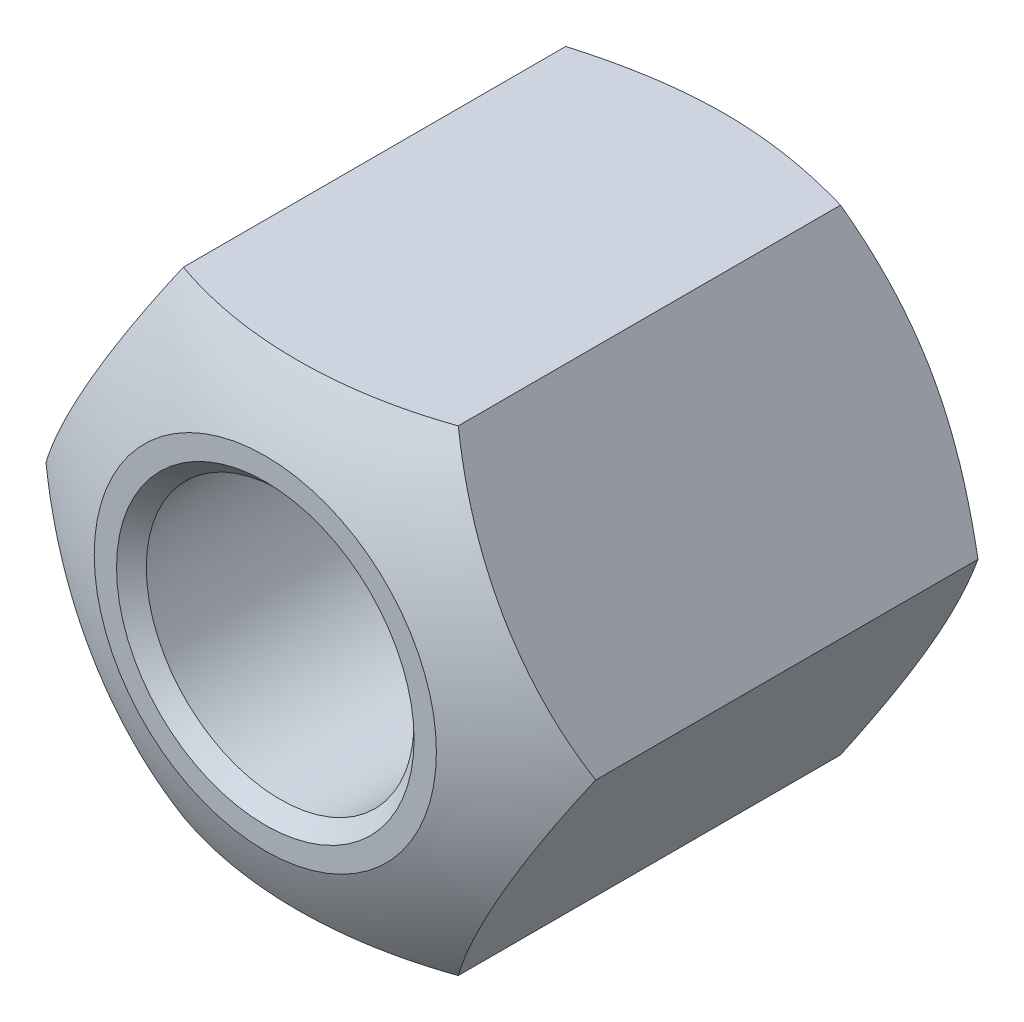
ISO-10303-21;
HEADER;
FILE_DESCRIPTION(('STEP AP214'),'2;1');
FILE_NAME('part.step','',(''),(''),'','','');
FILE_SCHEMA(('AUTOMOTIVE_DESIGN { 1 0 10303 214 1 1 1 1 }'));
ENDSEC;
DATA;
#1=APPLICATION_CONTEXT('core data for automotive mechanical design processes');
#2=APPLICATION_PROTOCOL_DEFINITION('international standard','automotive_design',2000,#1);
#3=PRODUCT_CONTEXT('',#1,'mechanical');
#4=PRODUCT('Part','Part','',(#3));
#5=PRODUCT_RELATED_PRODUCT_CATEGORY('part','',(#4));
#6=PRODUCT_DEFINITION_FORMATION('','',#4);
#7=PRODUCT_DEFINITION_CONTEXT('part definition',#1,'design');
#8=PRODUCT_DEFINITION('design','',#6,#7);
#9=PRODUCT_DEFINITION_SHAPE('','',#8);
#10=(LENGTH_UNIT() NAMED_UNIT(*) SI_UNIT(.MILLI.,.METRE.));
#11=(NAMED_UNIT(*) PLANE_ANGLE_UNIT() SI_UNIT($,.RADIAN.));
#12=(NAMED_UNIT(*) SI_UNIT($,.STERADIAN.) SOLID_ANGLE_UNIT());
#13=UNCERTAINTY_MEASURE_WITH_UNIT(LENGTH_MEASURE(1.E-05),#10,'distance_accuracy_value','');
#14=(GEOMETRIC_REPRESENTATION_CONTEXT(3) GLOBAL_UNCERTAINTY_ASSIGNED_CONTEXT((#13)) GLOBAL_UNIT_ASSIGNED_CONTEXT((#10,
#11,#12)) REPRESENTATION_CONTEXT('',''));
#15=CARTESIAN_POINT('',(0.,0.,0.));
#16=DIRECTION('',(0.,0.,1.));
#17=DIRECTION('',(1.,0.,0.));
#18=AXIS2_PLACEMENT_3D('',#15,#16,#17);
#19=CARTESIAN_POINT('',(-4.61880215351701,-8.,-16.35));
#20=DIRECTION('',(0.,-1.,0.));
#21=DIRECTION('',(1.,0.,0.));
#22=AXIS2_PLACEMENT_3D('',#19,#20,#21);
#23=PLANE('',#22);
#24=CARTESIAN_POINT('',(-12.1225352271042,-8.,-11.6627134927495));
#25=CARTESIAN_POINT('',(-11.7753653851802,-8.,-11.829958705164));
#26=CARTESIAN_POINT('',(-11.4273672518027,-8.,-11.9955156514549));
#27=CARTESIAN_POINT('',(-10.7292726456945,-8.,-12.3222971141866));
#28=CARTESIAN_POINT('',(-10.3791758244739,-8.,-12.4835208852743));
#29=CARTESIAN_POINT('',(-9.67449808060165,-8.,-12.8015530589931));
#30=CARTESIAN_POINT('',(-9.31990289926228,-8.,-12.958329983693));
#31=CARTESIAN_POINT('',(-8.6077903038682,-8.,-13.2650748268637));
#32=CARTESIAN_POINT('',(-8.25027303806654,-8.,-13.4150430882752));
#33=CARTESIAN_POINT('',(-7.52143735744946,-8.,-13.7105430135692));
#34=CARTESIAN_POINT('',(-7.1500169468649,-8.,-13.8558245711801));
#35=CARTESIAN_POINT('',(-6.40272828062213,-8.,-14.1346879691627));
#36=CARTESIAN_POINT('',(-6.02685951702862,-8.,-14.2682684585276));
#37=CARTESIAN_POINT('',(-5.27087191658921,-8.,-14.5200128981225));
#38=CARTESIAN_POINT('',(-4.89076447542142,-8.,-14.6382106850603));
#39=CARTESIAN_POINT('',(-4.12512238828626,-8.,-14.8552140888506));
#40=CARTESIAN_POINT('',(-3.7395895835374,-8.,-14.9540261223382));
#41=CARTESIAN_POINT('',(-2.96485562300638,-8.,-15.1268267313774));
#42=CARTESIAN_POINT('',(-2.57568219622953,-8.,-15.2009361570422));
#43=CARTESIAN_POINT('',(-1.9886170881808,-8.,-15.2902220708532));
#44=CARTESIAN_POINT('',(-1.792361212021,-8.,-15.3163389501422));
#45=CARTESIAN_POINT('',(-1.39897373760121,-8.,-15.3607626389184));
#46=CARTESIAN_POINT('',(-1.20184222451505,-8.,-15.3790701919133));
#47=CARTESIAN_POINT('',(-0.809415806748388,-8.,-15.4072947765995));
#48=CARTESIAN_POINT('',(-0.614128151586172,-8.,-15.4173122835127));
#49=CARTESIAN_POINT('',(-0.223305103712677,-8.,-15.4291058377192));
#50=CARTESIAN_POINT('',(-0.0277697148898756,-7.99999999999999,-15.4308820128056));
#51=CARTESIAN_POINT('',(0.363204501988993,-7.99999999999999,-15.4261505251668));
#52=CARTESIAN_POINT('',(0.558643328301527,-7.99999999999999,-15.4196427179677));
#53=CARTESIAN_POINT('',(0.949083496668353,-7.99999999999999,-15.398496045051));
#54=CARTESIAN_POINT('',(1.14408481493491,-7.99999999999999,-15.3838567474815));
#55=CARTESIAN_POINT('',(1.62163389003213,-7.99999999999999,-15.3383469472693));
#56=CARTESIAN_POINT('',(1.90377365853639,-7.99999999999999,-15.3031261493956));
#57=CARTESIAN_POINT('',(2.4657690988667,-7.99999999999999,-15.2176523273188));
#58=CARTESIAN_POINT('',(2.74562441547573,-7.99999999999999,-15.1673970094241));
#59=CARTESIAN_POINT('',(3.30284936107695,-7.99999999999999,-15.0536425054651));
#60=CARTESIAN_POINT('',(3.58021670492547,-7.99999999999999,-14.9901322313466));
#61=CARTESIAN_POINT('',(4.13207977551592,-7.99999999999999,-14.8517872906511));
#62=CARTESIAN_POINT('',(4.40657556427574,-7.99999999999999,-14.7769528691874));
#63=CARTESIAN_POINT('',(4.95865588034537,-7.99999999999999,-14.6160145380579));
#64=CARTESIAN_POINT('',(5.23617926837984,-7.99999999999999,-14.5297023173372));
#65=CARTESIAN_POINT('',(5.78849123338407,-7.99999999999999,-14.3487743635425));
#66=CARTESIAN_POINT('',(6.06327979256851,-7.99999999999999,-14.2541585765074));
#67=CARTESIAN_POINT('',(6.61026915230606,-7.99999999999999,-14.0580714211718));
#68=CARTESIAN_POINT('',(6.88247090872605,-7.99999999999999,-13.9566027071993));
#69=CARTESIAN_POINT('',(7.42466027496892,-7.99999999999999,-13.7479427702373));
#70=CARTESIAN_POINT('',(7.69464790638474,-7.99999999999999,-13.6407516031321));
#71=CARTESIAN_POINT('',(8.31298977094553,-7.99999999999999,-13.3888930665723));
#72=CARTESIAN_POINT('',(8.66067702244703,-7.99999999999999,-13.2425909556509));
#73=CARTESIAN_POINT('',(9.35330444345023,-7.99999999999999,-12.9436056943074));
#74=CARTESIAN_POINT('',(9.69824447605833,-7.99999999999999,-12.7909222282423));
#75=CARTESIAN_POINT('',(10.3858641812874,-7.99999999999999,-12.4804122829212));
#76=CARTESIAN_POINT('',(10.7285434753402,-7.99999999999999,-12.3225849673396));
#77=CARTESIAN_POINT('',(11.4119624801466,-7.99999999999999,-12.0027786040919));
#78=CARTESIAN_POINT('',(11.7527021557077,-7.99999999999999,-11.8407994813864));
#79=CARTESIAN_POINT('',(12.432855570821,-7.99999999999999,-11.513294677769));
#80=CARTESIAN_POINT('',(12.7722678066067,-7.99999999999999,-11.3477658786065));
#81=CARTESIAN_POINT('',(13.4497044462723,-7.99999999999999,-11.0138899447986));
#82=CARTESIAN_POINT('',(13.7877288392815,-7.99999999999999,-10.8455427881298));
#83=CARTESIAN_POINT('',(14.7999679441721,-7.99999999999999,-10.3370351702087));
#84=CARTESIAN_POINT('',(15.4724231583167,-7.99999999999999,-9.99337238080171));
#85=CARTESIAN_POINT('',(16.7611438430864,-7.99999999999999,-9.32668709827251));
#86=CARTESIAN_POINT('',(17.3776699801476,-7.99999999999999,-9.00416638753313));
#87=CARTESIAN_POINT('',(18.608483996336,-7.99999999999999,-8.35484224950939));
#88=CARTESIAN_POINT('',(19.2227718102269,-7.99999999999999,-8.02803869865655));
#89=CARTESIAN_POINT('',(20.4482749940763,-7.99999999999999,-7.37185385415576));
#90=CARTESIAN_POINT('',(21.0594941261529,-7.99999999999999,-7.04247957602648));
#91=CARTESIAN_POINT('',(22.2804919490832,-7.99999999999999,-6.38113956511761));
#92=CARTESIAN_POINT('',(22.8902707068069,-7.99999999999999,-6.04917395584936));
#93=CARTESIAN_POINT('',(23.4995139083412,-7.99999999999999,-5.71623469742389));
#94=B_SPLINE_CURVE_WITH_KNOTS('',3,(#24,#25,#26,#27,#28,#29,#30,#31,#32,#33,#34,#35,#36,#37,#38,
#39,#40,#41,#42,#43,#44,#45,#46,#47,#48,#49,#50,#51,#52,#53,#54,#55,#56,#57,#58,#59,#60,#61,#62,
#63,#64,#65,#66,#67,#68,#69,#70,#71,#72,#73,#74,#75,#76,#77,#78,#79,#80,#81,#82,#83,#84,#85,#86,
#87,#88,#89,#90,#91,#92,#93),.UNSPECIFIED.,.F.,.F.,(4,2,2,2,2,2,2,2,2,2,2,2,2,2,2,2,2,2,2,2,2,2,
2,2,2,2,2,2,2,2,2,2,2,2,4),(0.,1.15607819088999,2.31235398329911,3.47541792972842,
4.63842322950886,5.83473974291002,7.03119420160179,8.22497070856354,9.41835140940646,
10.6058050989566,11.1996320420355,11.7934024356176,12.3798663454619,12.9663211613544,
13.5527862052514,14.1392823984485,14.9917932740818,15.8444342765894,16.6977914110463,
17.5511300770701,18.4228801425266,19.294635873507,20.1660558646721,21.0374673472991,
22.1690257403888,23.3006401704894,24.4324395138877,25.5642593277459,26.6971178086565,
27.8299851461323,30.0954711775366,32.1828238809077,34.2702369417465,36.3531816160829,
38.43602760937),.UNSPECIFIED.);
#95=CARTESIAN_POINT('',(4.61880215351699,-8.00000000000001,-14.715));
#96=VERTEX_POINT('',#95);
#97=CARTESIAN_POINT('',(-4.61880215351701,-8.,-14.715));
#98=VERTEX_POINT('',#97);
#99=EDGE_CURVE('E203',#96,#98,#94,.F.);
#100=ORIENTED_EDGE('',*,*,#99,.F.);
#101=DIRECTION('',(0.,0.,1.));
#102=VECTOR('',#101,1.);
#103=CARTESIAN_POINT('',(4.618802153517,-7.99999999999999,-16.35));
#104=LINE('',#103,#102);
#105=CARTESIAN_POINT('',(4.618802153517,-7.99999999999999,-1.86714642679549));
#106=VERTEX_POINT('',#105);
#107=EDGE_CURVE('E64',#96,#106,#104,.T.);
#108=ORIENTED_EDGE('',*,*,#107,.T.);
#109=CARTESIAN_POINT('',(0.,-7.99999999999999,-14.9310917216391));
#110=DIRECTION('',(0.,-1.,0.));
#111=DIRECTION('',(1.,0.,0.));
#112=AXIS2_PLACEMENT_3D('',#109,#110,#111);
#113=CIRCLE('',#112,13.856406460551);
#114=CARTESIAN_POINT('',(-4.61880215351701,-8.,-1.86714642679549));
#115=VERTEX_POINT('',#114);
#116=EDGE_CURVE('E124',#106,#115,#113,.T.);
#117=ORIENTED_EDGE('',*,*,#116,.T.);
#118=DIRECTION('',(0.,0.,1.));
#119=VECTOR('',#118,1.);
#120=CARTESIAN_POINT('',(-4.61880215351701,-8.,-16.35));
#121=LINE('',#120,#119);
#122=EDGE_CURVE('E129',#98,#115,#121,.T.);
#123=ORIENTED_EDGE('',*,*,#122,.F.);
#124=EDGE_LOOP('',(#100,#108,#117,#123));
#125=FACE_BOUND('',#124,.T.);
#126=ADVANCED_FACE('F41',(#125),#23,.T.);
#127=CARTESIAN_POINT('',(-9.23760430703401,0.,-16.35));
#128=DIRECTION('',(-0.866025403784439,-0.5,0.));
#129=DIRECTION('',(0.5,-0.866025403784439,0.));
#130=AXIS2_PLACEMENT_3D('',#127,#128,#129);
#131=PLANE('',#130);
#132=CARTESIAN_POINT('',(-4.61868668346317,-8.0002,-14.7149333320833));
#133=CARTESIAN_POINT('',(-4.7202130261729,-7.8243512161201,-14.773540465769));
#134=CARTESIAN_POINT('',(-4.82211789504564,-7.64784680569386,-14.829487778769));
#135=CARTESIAN_POINT('',(-5.02675523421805,-7.29340453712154,-14.9353301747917));
#136=CARTESIAN_POINT('',(-5.1294880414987,-7.11546609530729,-14.9852226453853));
#137=CARTESIAN_POINT('',(-5.43933133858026,-6.57880176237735,-15.1248383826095));
#138=CARTESIAN_POINT('',(-5.64766491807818,-6.21795741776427,-15.2042500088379));
#139=CARTESIAN_POINT('',(-5.95943209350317,-5.67796082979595,-15.2973695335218));
#140=CARTESIAN_POINT('',(-6.06193429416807,-5.50042181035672,-15.3238965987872));
#141=CARTESIAN_POINT('',(-6.26740224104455,-5.1445408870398,-15.3683780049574));
#142=CARTESIAN_POINT('',(-6.37036794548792,-4.96619905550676,-15.3863331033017));
#143=CARTESIAN_POINT('',(-6.57647664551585,-4.60920831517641,-15.4132155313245));
#144=CARTESIAN_POINT('',(-6.67961930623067,-4.4305599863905,-15.4221531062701));
#145=CARTESIAN_POINT('',(-6.88599991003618,-4.07309829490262,-15.4308088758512));
#146=CARTESIAN_POINT('',(-6.98923785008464,-3.89428493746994,-15.4305273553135));
#147=CARTESIAN_POINT('',(-7.18224506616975,-3.5599866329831,-15.4213861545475));
#148=CARTESIAN_POINT('',(-7.27202796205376,-3.40447809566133,-15.4136415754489));
#149=CARTESIAN_POINT('',(-7.45138347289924,-3.09382523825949,-15.3913300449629));
#150=CARTESIAN_POINT('',(-7.5409560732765,-2.93868094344,-15.3767626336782));
#151=CARTESIAN_POINT('',(-7.80932710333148,-2.47384868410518,-15.3231704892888));
#152=CARTESIAN_POINT('',(-7.98765049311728,-2.16498351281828,-15.2742625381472));
#153=CARTESIAN_POINT('',(-8.34618890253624,-1.5439767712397,-15.151991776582));
#154=CARTESIAN_POINT('',(-8.52635816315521,-1.23191445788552,-15.0781106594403));
#155=CARTESIAN_POINT('',(-8.88400987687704,-0.61244351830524,-14.9104310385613));
#156=CARTESIAN_POINT('',(-9.06149691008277,-0.305026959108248,-14.8166719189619));
#157=CARTESIAN_POINT('',(-9.23771977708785,0.000200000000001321,-14.7149333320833));
#158=B_SPLINE_CURVE_WITH_KNOTS('',3,(#132,#133,#134,#135,#136,#137,#138,#139,#140,#141,#142,
#143,#144,#145,#146,#147,#148,#149,#150,#151,#152,#153,#154,#155,#156,#157),.UNSPECIFIED.,.F.,
.F.,(4,2,2,2,2,2,2,2,2,2,2,2,4),(0.,0.633973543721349,1.26821965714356,2.53934712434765,
3.15934343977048,3.77928496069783,4.39852133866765,5.01773858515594,5.55680239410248,
6.09590254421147,7.17487077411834,8.27776850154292,9.37850115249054),.UNSPECIFIED.);
#159=CARTESIAN_POINT('',(-9.23760430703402,0.,-14.715));
#160=VERTEX_POINT('',#159);
#161=EDGE_CURVE('E197',#98,#160,#158,.T.);
#162=ORIENTED_EDGE('',*,*,#161,.F.);
#163=ORIENTED_EDGE('',*,*,#122,.T.);
#164=CARTESIAN_POINT('',(-6.92820323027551,-4.,-14.9310917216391));
#165=DIRECTION('',(-0.866025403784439,-0.5,0.));
#166=DIRECTION('',(0.5,-0.866025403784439,0.));
#167=AXIS2_PLACEMENT_3D('',#164,#165,#166);
#168=CIRCLE('',#167,13.856406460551);
#169=CARTESIAN_POINT('',(-9.23760430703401,0.,-1.86714642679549));
#170=VERTEX_POINT('',#169);
#171=EDGE_CURVE('E247',#115,#170,#168,.T.);
#172=ORIENTED_EDGE('',*,*,#171,.T.);
#173=DIRECTION('',(0.,0.,1.));
#174=VECTOR('',#173,1.);
#175=CARTESIAN_POINT('',(-9.23760430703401,0.,-16.35));
#176=LINE('',#175,#174);
#177=EDGE_CURVE('E118',#160,#170,#176,.T.);
#178=ORIENTED_EDGE('',*,*,#177,.F.);
#179=EDGE_LOOP('',(#162,#163,#172,#178));
#180=FACE_BOUND('',#179,.T.);
#181=ADVANCED_FACE('F209',(#180),#131,.T.);
#182=CARTESIAN_POINT('',(-4.618802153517,8.,-16.35));
#183=DIRECTION('',(-0.866025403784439,0.5,0.));
#184=DIRECTION('',(-0.5,-0.866025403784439,0.));
#185=AXIS2_PLACEMENT_3D('',#182,#183,#184);
#186=PLANE('',#185);
#187=CARTESIAN_POINT('',(-9.23771977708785,-0.000199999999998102,-14.7149333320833));
#188=CARTESIAN_POINT('',(-9.13619343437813,0.175648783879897,-14.773540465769));
#189=CARTESIAN_POINT('',(-9.03428856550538,0.352153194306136,-14.829487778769));
#190=CARTESIAN_POINT('',(-8.82965122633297,0.70659546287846,-14.9353301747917));
#191=CARTESIAN_POINT('',(-8.72691841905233,0.884533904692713,-14.9852226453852));
#192=CARTESIAN_POINT('',(-8.41707512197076,1.42119823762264,-15.1248383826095));
#193=CARTESIAN_POINT('',(-8.20874154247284,1.78204258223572,-15.2042500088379));
#194=CARTESIAN_POINT('',(-7.89697436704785,2.32203917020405,-15.2973695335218));
#195=CARTESIAN_POINT('',(-7.79447216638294,2.49957818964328,-15.3238965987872));
#196=CARTESIAN_POINT('',(-7.58900421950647,2.8554591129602,-15.3683780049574));
#197=CARTESIAN_POINT('',(-7.4860385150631,3.03380094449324,-15.3863331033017));
#198=CARTESIAN_POINT('',(-7.27992981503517,3.39079168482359,-15.4132155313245));
#199=CARTESIAN_POINT('',(-7.17678715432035,3.5694400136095,-15.4221531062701));
#200=CARTESIAN_POINT('',(-6.97040655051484,3.92690170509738,-15.4308088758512));
#201=CARTESIAN_POINT('',(-6.86716861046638,4.10571506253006,-15.4305273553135));
#202=CARTESIAN_POINT('',(-6.67416139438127,4.4400133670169,-15.4213861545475));
#203=CARTESIAN_POINT('',(-6.58437849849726,4.59552190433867,-15.4136415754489));
#204=CARTESIAN_POINT('',(-6.40502298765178,4.90617476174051,-15.3913300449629));
#205=CARTESIAN_POINT('',(-6.31545038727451,5.06131905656,-15.3767626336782));
#206=CARTESIAN_POINT('',(-6.04707935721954,5.52615131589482,-15.3231704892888));
#207=CARTESIAN_POINT('',(-5.86875596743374,5.83501648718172,-15.2742625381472));
#208=CARTESIAN_POINT('',(-5.51021755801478,6.4560232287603,-15.151991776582));
#209=CARTESIAN_POINT('',(-5.3300482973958,6.76808554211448,-15.0781106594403));
#210=CARTESIAN_POINT('',(-4.97239658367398,7.38755648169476,-14.9104310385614));
#211=CARTESIAN_POINT('',(-4.79490955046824,7.69497304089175,-14.8166719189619));
#212=CARTESIAN_POINT('',(-4.61868668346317,8.0002,-14.7149333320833));
#213=B_SPLINE_CURVE_WITH_KNOTS('',3,(#187,#188,#189,#190,#191,#192,#193,#194,#195,#196,#197,
#198,#199,#200,#201,#202,#203,#204,#205,#206,#207,#208,#209,#210,#211,#212),.UNSPECIFIED.,.F.,
.F.,(4,2,2,2,2,2,2,2,2,2,2,2,4),(0.,0.633973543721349,1.26821965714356,2.53934712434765,
3.15934343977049,3.77928496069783,4.39852133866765,5.01773858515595,5.55680239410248,
6.09590254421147,7.17487077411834,8.27776850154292,9.37850115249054),.UNSPECIFIED.);
#214=CARTESIAN_POINT('',(-4.618802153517,8.,-14.715));
#215=VERTEX_POINT('',#214);
#216=EDGE_CURVE('E98',#160,#215,#213,.T.);
#217=ORIENTED_EDGE('',*,*,#216,.F.);
#218=ORIENTED_EDGE('',*,*,#177,.T.);
#219=CARTESIAN_POINT('',(-6.92820323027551,4.,-14.9310917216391));
#220=DIRECTION('',(-0.866025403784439,0.5,0.));
#221=DIRECTION('',(-0.5,-0.866025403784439,0.));
#222=AXIS2_PLACEMENT_3D('',#219,#220,#221);
#223=CIRCLE('',#222,13.856406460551);
#224=CARTESIAN_POINT('',(-4.618802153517,8.,-1.86714642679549));
#225=VERTEX_POINT('',#224);
#226=EDGE_CURVE('E244',#170,#225,#223,.T.);
#227=ORIENTED_EDGE('',*,*,#226,.T.);
#228=DIRECTION('',(0.,0.,1.));
#229=VECTOR('',#228,1.);
#230=CARTESIAN_POINT('',(-4.618802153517,8.,-16.35));
#231=LINE('',#230,#229);
#232=EDGE_CURVE('E116',#215,#225,#231,.T.);
#233=ORIENTED_EDGE('',*,*,#232,.F.);
#234=EDGE_LOOP('',(#217,#218,#227,#233));
#235=FACE_BOUND('',#234,.T.);
#236=ADVANCED_FACE('F213',(#235),#186,.T.);
#237=CARTESIAN_POINT('',(4.618802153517,8.,-16.35));
#238=DIRECTION('',(0.,1.,0.));
#239=DIRECTION('',(-1.,0.,0.));
#240=AXIS2_PLACEMENT_3D('',#237,#238,#239);
#241=PLANE('',#240);
#242=CARTESIAN_POINT('',(-12.1225352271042,8.,-11.6627134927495));
#243=CARTESIAN_POINT('',(-11.7753653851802,8.,-11.829958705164));
#244=CARTESIAN_POINT('',(-11.4273672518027,8.,-11.9955156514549));
#245=CARTESIAN_POINT('',(-10.7292726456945,8.,-12.3222971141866));
#246=CARTESIAN_POINT('',(-10.3791758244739,8.,-12.4835208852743));
#247=CARTESIAN_POINT('',(-9.67449808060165,8.,-12.8015530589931));
#248=CARTESIAN_POINT('',(-9.31990289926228,8.,-12.958329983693));
#249=CARTESIAN_POINT('',(-8.6077903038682,8.,-13.2650748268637));
#250=CARTESIAN_POINT('',(-8.25027303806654,8.,-13.4150430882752));
#251=CARTESIAN_POINT('',(-7.52143735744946,8.,-13.7105430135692));
#252=CARTESIAN_POINT('',(-7.1500169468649,8.,-13.8558245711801));
#253=CARTESIAN_POINT('',(-6.40272828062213,8.,-14.1346879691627));
#254=CARTESIAN_POINT('',(-6.02685951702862,8.,-14.2682684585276));
#255=CARTESIAN_POINT('',(-5.27087191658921,8.,-14.5200128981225));
#256=CARTESIAN_POINT('',(-4.89076447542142,8.,-14.6382106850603));
#257=CARTESIAN_POINT('',(-4.12512238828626,8.,-14.8552140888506));
#258=CARTESIAN_POINT('',(-3.7395895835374,8.,-14.9540261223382));
#259=CARTESIAN_POINT('',(-2.96485562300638,8.,-15.1268267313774));
#260=CARTESIAN_POINT('',(-2.57568219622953,8.,-15.2009361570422));
#261=CARTESIAN_POINT('',(-1.9886170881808,8.,-15.2902220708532));
#262=CARTESIAN_POINT('',(-1.792361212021,8.,-15.3163389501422));
#263=CARTESIAN_POINT('',(-1.39897373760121,8.,-15.3607626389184));
#264=CARTESIAN_POINT('',(-1.20184222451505,8.,-15.3790701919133));
#265=CARTESIAN_POINT('',(-0.809415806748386,8.,-15.4072947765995));
#266=CARTESIAN_POINT('',(-0.614128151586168,8.,-15.4173122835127));
#267=CARTESIAN_POINT('',(-0.223305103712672,8.,-15.4291058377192));
#268=CARTESIAN_POINT('',(-0.0277697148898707,8.,-15.4308820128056));
#269=CARTESIAN_POINT('',(0.363204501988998,8.,-15.4261505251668));
#270=CARTESIAN_POINT('',(0.558643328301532,8.,-15.4196427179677));
#271=CARTESIAN_POINT('',(0.949083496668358,8.,-15.398496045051));
#272=CARTESIAN_POINT('',(1.14408481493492,8.,-15.3838567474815));
#273=CARTESIAN_POINT('',(1.62163389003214,8.,-15.3383469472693));
#274=CARTESIAN_POINT('',(1.9037736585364,8.,-15.3031261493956));
#275=CARTESIAN_POINT('',(2.46576909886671,8.,-15.2176523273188));
#276=CARTESIAN_POINT('',(2.74562441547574,8.,-15.1673970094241));
#277=CARTESIAN_POINT('',(3.30284936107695,8.,-15.0536425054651));
#278=CARTESIAN_POINT('',(3.58021670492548,8.,-14.9901322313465));
#279=CARTESIAN_POINT('',(4.13207977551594,8.,-14.8517872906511));
#280=CARTESIAN_POINT('',(4.40657556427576,8.,-14.7769528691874));
#281=CARTESIAN_POINT('',(4.95865588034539,8.,-14.6160145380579));
#282=CARTESIAN_POINT('',(5.23617926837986,8.,-14.5297023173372));
#283=CARTESIAN_POINT('',(5.78849123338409,8.,-14.3487743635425));
#284=CARTESIAN_POINT('',(6.06327979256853,8.,-14.2541585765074));
#285=CARTESIAN_POINT('',(6.61026915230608,8.,-14.0580714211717));
#286=CARTESIAN_POINT('',(6.88247090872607,8.,-13.9566027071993));
#287=CARTESIAN_POINT('',(7.42466027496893,8.,-13.7479427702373));
#288=CARTESIAN_POINT('',(7.69464790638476,8.,-13.6407516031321));
#289=CARTESIAN_POINT('',(8.31298977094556,8.,-13.3888930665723));
#290=CARTESIAN_POINT('',(8.66067702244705,8.,-13.2425909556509));
#291=CARTESIAN_POINT('',(9.35330444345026,8.,-12.9436056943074));
#292=CARTESIAN_POINT('',(9.69824447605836,8.,-12.7909222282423));
#293=CARTESIAN_POINT('',(10.3858641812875,8.,-12.4804122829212));
#294=CARTESIAN_POINT('',(10.7285434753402,8.,-12.3225849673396));
#295=CARTESIAN_POINT('',(11.4119624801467,8.,-12.0027786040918));
#296=CARTESIAN_POINT('',(11.7527021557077,8.,-11.8407994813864));
#297=CARTESIAN_POINT('',(12.432855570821,8.,-11.513294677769));
#298=CARTESIAN_POINT('',(12.7722678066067,8.,-11.3477658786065));
#299=CARTESIAN_POINT('',(13.4497044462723,8.,-11.0138899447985));
#300=CARTESIAN_POINT('',(13.7877288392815,8.,-10.8455427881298));
#301=CARTESIAN_POINT('',(14.7999679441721,8.,-10.3370351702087));
#302=CARTESIAN_POINT('',(15.4724231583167,8.,-9.9933723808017));
#303=CARTESIAN_POINT('',(16.7611438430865,8.,-9.3266870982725));
#304=CARTESIAN_POINT('',(17.3776699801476,8.,-9.00416638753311));
#305=CARTESIAN_POINT('',(18.6084839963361,8.,-8.35484224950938));
#306=CARTESIAN_POINT('',(19.2227718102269,8.,-8.02803869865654));
#307=CARTESIAN_POINT('',(20.4482749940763,8.,-7.37185385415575));
#308=CARTESIAN_POINT('',(21.059494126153,8.,-7.04247957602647));
#309=CARTESIAN_POINT('',(22.2804919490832,8.,-6.3811395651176));
#310=CARTESIAN_POINT('',(22.8902707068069,8.,-6.04917395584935));
#311=CARTESIAN_POINT('',(23.4995139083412,8.,-5.71623469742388));
#312=B_SPLINE_CURVE_WITH_KNOTS('',3,(#242,#243,#244,#245,#246,#247,#248,#249,#250,#251,#252,
#253,#254,#255,#256,#257,#258,#259,#260,#261,#262,#263,#264,#265,#266,#267,#268,#269,#270,#271,
#272,#273,#274,#275,#276,#277,#278,#279,#280,#281,#282,#283,#284,#285,#286,#287,#288,#289,#290,
#291,#292,#293,#294,#295,#296,#297,#298,#299,#300,#301,#302,#303,#304,#305,#306,#307,#308,#309,
#310,#311),.UNSPECIFIED.,.F.,.F.,(4,2,2,2,2,2,2,2,2,2,2,2,2,2,2,2,2,2,2,2,2,2,2,2,2,2,2,2,2,2,2,
2,2,2,4),(0.,1.15607819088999,2.31235398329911,3.47541792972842,4.63842322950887,
5.83473974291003,7.03119420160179,8.22497070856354,9.41835140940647,10.6058050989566,
11.1996320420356,11.7934024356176,12.3798663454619,12.9663211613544,13.5527862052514,
14.1392823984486,14.9917932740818,15.8444342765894,16.6977914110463,17.5511300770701,
18.4228801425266,19.294635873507,20.1660558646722,21.0374673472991,22.1690257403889,
23.3006401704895,24.4324395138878,25.564259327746,26.6971178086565,27.8299851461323,
30.0954711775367,32.1828238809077,34.2702369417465,36.353181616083,38.43602760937),.UNSPECIFIED.);
#313=CARTESIAN_POINT('',(4.618802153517,8.00000000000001,-14.715));
#314=VERTEX_POINT('',#313);
#315=EDGE_CURVE('E94',#215,#314,#312,.T.);
#316=ORIENTED_EDGE('',*,*,#315,.F.);
#317=ORIENTED_EDGE('',*,*,#232,.T.);
#318=CARTESIAN_POINT('',(0.,8.,-14.9310917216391));
#319=DIRECTION('',(0.,1.,0.));
#320=DIRECTION('',(-1.,0.,0.));
#321=AXIS2_PLACEMENT_3D('',#318,#319,#320);
#322=CIRCLE('',#321,13.856406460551);
#323=CARTESIAN_POINT('',(4.618802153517,8.,-1.86714642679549));
#324=VERTEX_POINT('',#323);
#325=EDGE_CURVE('E115',#225,#324,#322,.T.);
#326=ORIENTED_EDGE('',*,*,#325,.T.);
#327=DIRECTION('',(0.,0.,1.));
#328=VECTOR('',#327,1.);
#329=CARTESIAN_POINT('',(4.618802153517,8.,-16.35));
#330=LINE('',#329,#328);
#331=EDGE_CURVE('E107',#314,#324,#330,.T.);
#332=ORIENTED_EDGE('',*,*,#331,.F.);
#333=EDGE_LOOP('',(#316,#317,#326,#332));
#334=FACE_BOUND('',#333,.T.);
#335=ADVANCED_FACE('F113',(#334),#241,.T.);
#336=CARTESIAN_POINT('',(9.23760430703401,0.,-16.35));
#337=DIRECTION('',(0.866025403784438,0.5,0.));
#338=DIRECTION('',(-0.5,0.866025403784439,0.));
#339=AXIS2_PLACEMENT_3D('',#336,#337,#338);
#340=PLANE('',#339);
#341=CARTESIAN_POINT('',(4.61868668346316,8.0002,-14.7149333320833));
#342=CARTESIAN_POINT('',(4.72021302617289,7.8243512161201,-14.773540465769));
#343=CARTESIAN_POINT('',(4.82211789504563,7.64784680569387,-14.829487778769));
#344=CARTESIAN_POINT('',(5.02675523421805,7.29340453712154,-14.9353301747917));
#345=CARTESIAN_POINT('',(5.12948804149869,7.11546609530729,-14.9852226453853));
#346=CARTESIAN_POINT('',(5.43933133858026,6.57880176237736,-15.1248383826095));
#347=CARTESIAN_POINT('',(5.64766491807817,6.21795741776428,-15.2042500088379));
#348=CARTESIAN_POINT('',(5.95943209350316,5.67796082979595,-15.2973695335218));
#349=CARTESIAN_POINT('',(6.06193429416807,5.50042181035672,-15.3238965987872));
#350=CARTESIAN_POINT('',(6.26740224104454,5.1445408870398,-15.3683780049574));
#351=CARTESIAN_POINT('',(6.37036794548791,4.96619905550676,-15.3863331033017));
#352=CARTESIAN_POINT('',(6.57647664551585,4.60920831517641,-15.4132155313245));
#353=CARTESIAN_POINT('',(6.67961930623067,4.4305599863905,-15.4221531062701));
#354=CARTESIAN_POINT('',(6.88599991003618,4.07309829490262,-15.4308088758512));
#355=CARTESIAN_POINT('',(6.98923785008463,3.89428493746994,-15.4305273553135));
#356=CARTESIAN_POINT('',(7.18224506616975,3.5599866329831,-15.4213861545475));
#357=CARTESIAN_POINT('',(7.27202796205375,3.40447809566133,-15.4136415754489));
#358=CARTESIAN_POINT('',(7.45138347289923,3.09382523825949,-15.3913300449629));
#359=CARTESIAN_POINT('',(7.5409560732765,2.93868094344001,-15.3767626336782));
#360=CARTESIAN_POINT('',(7.80932710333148,2.47384868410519,-15.3231704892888));
#361=CARTESIAN_POINT('',(7.98765049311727,2.16498351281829,-15.2742625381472));
#362=CARTESIAN_POINT('',(8.34618890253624,1.54397677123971,-15.151991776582));
#363=CARTESIAN_POINT('',(8.52635816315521,1.23191445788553,-15.0781106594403));
#364=CARTESIAN_POINT('',(8.88400987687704,0.612443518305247,-14.9104310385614));
#365=CARTESIAN_POINT('',(9.06149691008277,0.305026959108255,-14.8166719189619));
#366=CARTESIAN_POINT('',(9.23771977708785,-0.000199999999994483,-14.7149333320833));
#367=B_SPLINE_CURVE_WITH_KNOTS('',3,(#341,#342,#343,#344,#345,#346,#347,#348,#349,#350,#351,
#352,#353,#354,#355,#356,#357,#358,#359,#360,#361,#362,#363,#364,#365,#366),.UNSPECIFIED.,.F.,
.F.,(4,2,2,2,2,2,2,2,2,2,2,2,4),(0.,0.63397354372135,1.26821965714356,2.53934712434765,
3.15934343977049,3.77928496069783,4.39852133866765,5.01773858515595,5.55680239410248,
6.09590254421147,7.17487077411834,8.27776850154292,9.37850115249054),.UNSPECIFIED.);
#368=CARTESIAN_POINT('',(9.23760430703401,0.,-14.715));
#369=VERTEX_POINT('',#368);
#370=EDGE_CURVE('E56',#314,#369,#367,.T.);
#371=ORIENTED_EDGE('',*,*,#370,.F.);
#372=ORIENTED_EDGE('',*,*,#331,.T.);
#373=CARTESIAN_POINT('',(6.9282032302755,4.,-14.9310917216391));
#374=DIRECTION('',(0.866025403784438,0.5,0.));
#375=DIRECTION('',(-0.5,0.866025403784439,0.));
#376=AXIS2_PLACEMENT_3D('',#373,#374,#375);
#377=CIRCLE('',#376,13.856406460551);
#378=CARTESIAN_POINT('',(9.23760430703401,0.,-1.86714642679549));
#379=VERTEX_POINT('',#378);
#380=EDGE_CURVE('E238',#324,#379,#377,.T.);
#381=ORIENTED_EDGE('',*,*,#380,.T.);
#382=DIRECTION('',(0.,0.,1.));
#383=VECTOR('',#382,1.);
#384=CARTESIAN_POINT('',(9.23760430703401,0.,-16.35));
#385=LINE('',#384,#383);
#386=EDGE_CURVE('E109',#369,#379,#385,.T.);
#387=ORIENTED_EDGE('',*,*,#386,.F.);
#388=EDGE_LOOP('',(#371,#372,#381,#387));
#389=FACE_BOUND('',#388,.T.);
#390=ADVANCED_FACE('F105',(#389),#340,.T.);
#391=CARTESIAN_POINT('',(4.618802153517,-7.99999999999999,-16.35));
#392=DIRECTION('',(0.866025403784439,-0.5,0.));
#393=DIRECTION('',(0.5,0.866025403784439,0.));
#394=AXIS2_PLACEMENT_3D('',#391,#392,#393);
#395=PLANE('',#394);
#396=CARTESIAN_POINT('',(9.23771977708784,0.00020000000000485,-14.7149333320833));
#397=CARTESIAN_POINT('',(9.13619343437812,-0.175648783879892,-14.773540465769));
#398=CARTESIAN_POINT('',(9.03428856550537,-0.352153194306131,-14.829487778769));
#399=CARTESIAN_POINT('',(8.82965122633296,-0.706595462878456,-14.9353301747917));
#400=CARTESIAN_POINT('',(8.72691841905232,-0.884533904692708,-14.9852226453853));
#401=CARTESIAN_POINT('',(8.41707512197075,-1.42119823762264,-15.1248383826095));
#402=CARTESIAN_POINT('',(8.20874154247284,-1.78204258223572,-15.204250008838));
#403=CARTESIAN_POINT('',(7.89697436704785,-2.32203917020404,-15.2973695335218));
#404=CARTESIAN_POINT('',(7.79447216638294,-2.49957818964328,-15.3238965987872));
#405=CARTESIAN_POINT('',(7.58900421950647,-2.85545911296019,-15.3683780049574));
#406=CARTESIAN_POINT('',(7.4860385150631,-3.03380094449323,-15.3863331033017));
#407=CARTESIAN_POINT('',(7.27992981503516,-3.39079168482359,-15.4132155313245));
#408=CARTESIAN_POINT('',(7.17678715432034,-3.56944001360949,-15.4221531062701));
#409=CARTESIAN_POINT('',(6.97040655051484,-3.92690170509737,-15.4308088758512));
#410=CARTESIAN_POINT('',(6.86716861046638,-4.10571506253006,-15.4305273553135));
#411=CARTESIAN_POINT('',(6.67416139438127,-4.44001336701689,-15.4213861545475));
#412=CARTESIAN_POINT('',(6.58437849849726,-4.59552190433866,-15.413641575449));
#413=CARTESIAN_POINT('',(6.40502298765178,-4.9061747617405,-15.3913300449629));
#414=CARTESIAN_POINT('',(6.31545038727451,-5.06131905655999,-15.3767626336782));
#415=CARTESIAN_POINT('',(6.04707935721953,-5.52615131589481,-15.3231704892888));
#416=CARTESIAN_POINT('',(5.86875596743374,-5.83501648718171,-15.2742625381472));
#417=CARTESIAN_POINT('',(5.51021755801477,-6.45602322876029,-15.151991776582));
#418=CARTESIAN_POINT('',(5.3300482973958,-6.76808554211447,-15.0781106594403));
#419=CARTESIAN_POINT('',(4.97239658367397,-7.38755648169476,-14.9104310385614));
#420=CARTESIAN_POINT('',(4.79490955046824,-7.69497304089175,-14.8166719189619));
#421=CARTESIAN_POINT('',(4.61868668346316,-8.0002,-14.7149333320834));
#422=B_SPLINE_CURVE_WITH_KNOTS('',3,(#396,#397,#398,#399,#400,#401,#402,#403,#404,#405,#406,
#407,#408,#409,#410,#411,#412,#413,#414,#415,#416,#417,#418,#419,#420,#421),.UNSPECIFIED.,.F.,
.F.,(4,2,2,2,2,2,2,2,2,2,2,2,4),(0.,0.633973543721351,1.26821965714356,2.53934712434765,
3.15934343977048,3.77928496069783,4.39852133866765,5.01773858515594,5.55680239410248,
6.09590254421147,7.17487077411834,8.27776850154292,9.37850115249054),.UNSPECIFIED.);
#423=EDGE_CURVE('E110',#369,#96,#422,.T.);
#424=ORIENTED_EDGE('',*,*,#423,.F.);
#425=ORIENTED_EDGE('',*,*,#386,.T.);
#426=CARTESIAN_POINT('',(6.9282032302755,-4.,-14.9310917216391));
#427=DIRECTION('',(0.866025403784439,-0.5,0.));
#428=DIRECTION('',(0.5,0.866025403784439,0.));
#429=AXIS2_PLACEMENT_3D('',#426,#427,#428);
#430=CIRCLE('',#429,13.856406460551);
#431=EDGE_CURVE('E236',#379,#106,#430,.T.);
#432=ORIENTED_EDGE('',*,*,#431,.T.);
#433=ORIENTED_EDGE('',*,*,#107,.F.);
#434=EDGE_LOOP('',(#424,#425,#432,#433));
#435=FACE_BOUND('',#434,.T.);
#436=ADVANCED_FACE('F173',(#435),#395,.T.);
#437=CARTESIAN_POINT('',(-4.61880215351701,-8.,0.));
#438=DIRECTION('',(0.,0.,-1.));
#439=DIRECTION('',(-1.,0.,0.));
#440=AXIS2_PLACEMENT_3D('',#437,#438,#439);
#441=PLANE('',#440);
#442=CARTESIAN_POINT('',(0.,0.,0.));
#443=DIRECTION('',(0.,0.,-1.));
#444=DIRECTION('',(-1.,0.,0.));
#445=AXIS2_PLACEMENT_3D('',#442,#443,#444);
#446=CIRCLE('',#445,4.99999999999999);
#447=CARTESIAN_POINT('',(-4.99999999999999,0.,0.));
#448=VERTEX_POINT('',#447);
#449=EDGE_CURVE('E49',#448,#448,#446,.T.);
#450=ORIENTED_EDGE('',*,*,#449,.T.);
#451=EDGE_LOOP('',(#450));
#452=FACE_BOUND('',#451,.T.);
#453=CARTESIAN_POINT('',(0.,0.,0.));
#454=DIRECTION('',(0.,0.,-1.));
#455=DIRECTION('',(-1.,0.,0.));
#456=AXIS2_PLACEMENT_3D('',#453,#454,#455);
#457=CIRCLE('',#456,5.75);
#458=CARTESIAN_POINT('',(-5.75,0.,0.));
#459=VERTEX_POINT('',#458);
#460=EDGE_CURVE('E233',#459,#459,#457,.T.);
#461=ORIENTED_EDGE('',*,*,#460,.F.);
#462=EDGE_LOOP('',(#461));
#463=FACE_BOUND('',#462,.T.);
#464=ADVANCED_FACE('F134',(#452,#463),#441,.F.);
#465=CARTESIAN_POINT('',(-4.61880215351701,-8.,-16.35));
#466=DIRECTION('',(0.,0.,-1.));
#467=DIRECTION('',(-1.,0.,0.));
#468=AXIS2_PLACEMENT_3D('',#465,#466,#467);
#469=PLANE('',#468);
#470=CARTESIAN_POINT('',(0.,0.,-16.35));
#471=DIRECTION('',(0.,0.,-1.));
#472=DIRECTION('',(-1.,0.,0.));
#473=AXIS2_PLACEMENT_3D('',#470,#471,#472);
#474=CIRCLE('',#473,5.);
#475=CARTESIAN_POINT('',(-5.,0.,-16.35));
#476=VERTEX_POINT('',#475);
#477=EDGE_CURVE('E11',#476,#476,#474,.F.);
#478=ORIENTED_EDGE('',*,*,#477,.T.);
#479=EDGE_LOOP('',(#478));
#480=FACE_BOUND('',#479,.T.);
#481=CARTESIAN_POINT('',(0.,0.,-16.35));
#482=DIRECTION('',(0.,0.,1.));
#483=DIRECTION('',(1.,0.,0.));
#484=AXIS2_PLACEMENT_3D('',#481,#482,#483);
#485=CIRCLE('',#484,6.40570123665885);
#486=CARTESIAN_POINT('',(6.40570123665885,0.,-16.35));
#487=VERTEX_POINT('',#486);
#488=EDGE_CURVE('E159',#487,#487,#485,.T.);
#489=ORIENTED_EDGE('',*,*,#488,.F.);
#490=EDGE_LOOP('',(#489));
#491=FACE_BOUND('',#490,.T.);
#492=ADVANCED_FACE('F146',(#480,#491),#469,.T.);
#493=CARTESIAN_POINT('',(0.,0.,-16.35));
#494=DIRECTION('',(0.,0.,1.));
#495=DIRECTION('',(1.,0.,0.));
#496=AXIS2_PLACEMENT_3D('',#493,#494,#495);
#497=CYLINDRICAL_SURFACE('',#496,4.5);
#498=CARTESIAN_POINT('',(0.,0.,-0.499999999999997));
#499=DIRECTION('',(0.,0.,-1.));
#500=DIRECTION('',(-1.,0.,0.));
#501=AXIS2_PLACEMENT_3D('',#498,#499,#500);
#502=CIRCLE('',#501,4.5);
#503=CARTESIAN_POINT('',(-4.5,0.,-0.499999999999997));
#504=VERTEX_POINT('',#503);
#505=EDGE_CURVE('E128',#504,#504,#502,.F.);
#506=ORIENTED_EDGE('',*,*,#505,.T.);
#507=EDGE_LOOP('',(#506));
#508=FACE_BOUND('',#507,.T.);
#509=CARTESIAN_POINT('',(0.,0.,-15.85));
#510=DIRECTION('',(0.,0.,-1.));
#511=DIRECTION('',(-1.,0.,0.));
#512=AXIS2_PLACEMENT_3D('',#509,#510,#511);
#513=CIRCLE('',#512,4.5);
#514=CARTESIAN_POINT('',(-4.5,0.,-15.85));
#515=VERTEX_POINT('',#514);
#516=EDGE_CURVE('E125',#515,#515,#513,.T.);
#517=ORIENTED_EDGE('',*,*,#516,.T.);
#518=EDGE_LOOP('',(#517));
#519=FACE_BOUND('',#518,.T.);
#520=ADVANCED_FACE('F142',(#508,#519),#497,.F.);
#521=CARTESIAN_POINT('',(0.,0.,-14.9310917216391));
#522=DIRECTION('',(0.,0.,-1.));
#523=DIRECTION('',(1.,0.,0.));
#524=AXIS2_PLACEMENT_3D('',#521,#522,#523);
#525=SPHERICAL_SURFACE('',#524,16.);
#526=ORIENTED_EDGE('',*,*,#460,.T.);
#527=EDGE_LOOP('',(#526));
#528=FACE_BOUND('',#527,.T.);
#529=ORIENTED_EDGE('',*,*,#431,.F.);
#530=ORIENTED_EDGE('',*,*,#380,.F.);
#531=ORIENTED_EDGE('',*,*,#325,.F.);
#532=ORIENTED_EDGE('',*,*,#226,.F.);
#533=ORIENTED_EDGE('',*,*,#171,.F.);
#534=ORIENTED_EDGE('',*,*,#116,.F.);
#535=EDGE_LOOP('',(#529,#530,#531,#532,#533,#534));
#536=FACE_BOUND('',#535,.T.);
#537=ADVANCED_FACE('F145',(#528,#536),#525,.T.);
#538=CARTESIAN_POINT('',(0.,0.,-16.35));
#539=DIRECTION('',(0.,0.,1.));
#540=DIRECTION('',(1.,0.,0.));
#541=AXIS2_PLACEMENT_3D('',#538,#539,#540);
#542=CONICAL_SURFACE('',#541,6.40570123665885,1.0471975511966);
#543=ORIENTED_EDGE('',*,*,#99,.T.);
#544=ORIENTED_EDGE('',*,*,#161,.T.);
#545=ORIENTED_EDGE('',*,*,#216,.T.);
#546=ORIENTED_EDGE('',*,*,#315,.T.);
#547=ORIENTED_EDGE('',*,*,#370,.T.);
#548=ORIENTED_EDGE('',*,*,#423,.T.);
#549=EDGE_LOOP('',(#543,#544,#545,#546,#547,#548));
#550=FACE_BOUND('',#549,.T.);
#551=ORIENTED_EDGE('',*,*,#488,.T.);
#552=EDGE_LOOP('',(#551));
#553=FACE_BOUND('',#552,.T.);
#554=ADVANCED_FACE('F95',(#550,#553),#542,.T.);
#555=CARTESIAN_POINT('',(0.,0.,-0.499999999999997));
#556=DIRECTION('',(0.,0.,1.));
#557=DIRECTION('',(1.,0.,0.));
#558=AXIS2_PLACEMENT_3D('',#555,#556,#557);
#559=CONICAL_SURFACE('',#558,4.5,0.785398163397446);
#560=ORIENTED_EDGE('',*,*,#449,.F.);
#561=EDGE_LOOP('',(#560));
#562=FACE_BOUND('',#561,.T.);
#563=ORIENTED_EDGE('',*,*,#505,.F.);
#564=EDGE_LOOP('',(#563));
#565=FACE_BOUND('',#564,.T.);
#566=ADVANCED_FACE('F137',(#562,#565),#559,.F.);
#567=CARTESIAN_POINT('',(0.,0.,-16.35));
#568=DIRECTION('',(0.,0.,-1.));
#569=DIRECTION('',(-1.,0.,0.));
#570=AXIS2_PLACEMENT_3D('',#567,#568,#569);
#571=CONICAL_SURFACE('',#570,5.,0.785398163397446);
#572=ORIENTED_EDGE('',*,*,#516,.F.);
#573=EDGE_LOOP('',(#572));
#574=FACE_BOUND('',#573,.T.);
#575=ORIENTED_EDGE('',*,*,#477,.F.);
#576=EDGE_LOOP('',(#575));
#577=FACE_BOUND('',#576,.T.);
#578=ADVANCED_FACE('F43',(#574,#577),#571,.F.);
#579=CLOSED_SHELL('',(#126,#181,#236,#335,#390,#436,#464,#492,#520,#537,#554,#566,#578));
#580=MANIFOLD_SOLID_BREP('B2',#579);
#581=ADVANCED_BREP_SHAPE_REPRESENTATION('',(#18,#580),#14);
#582=SHAPE_DEFINITION_REPRESENTATION(#9,#581);
ENDSEC;
END-ISO-10303-21;
